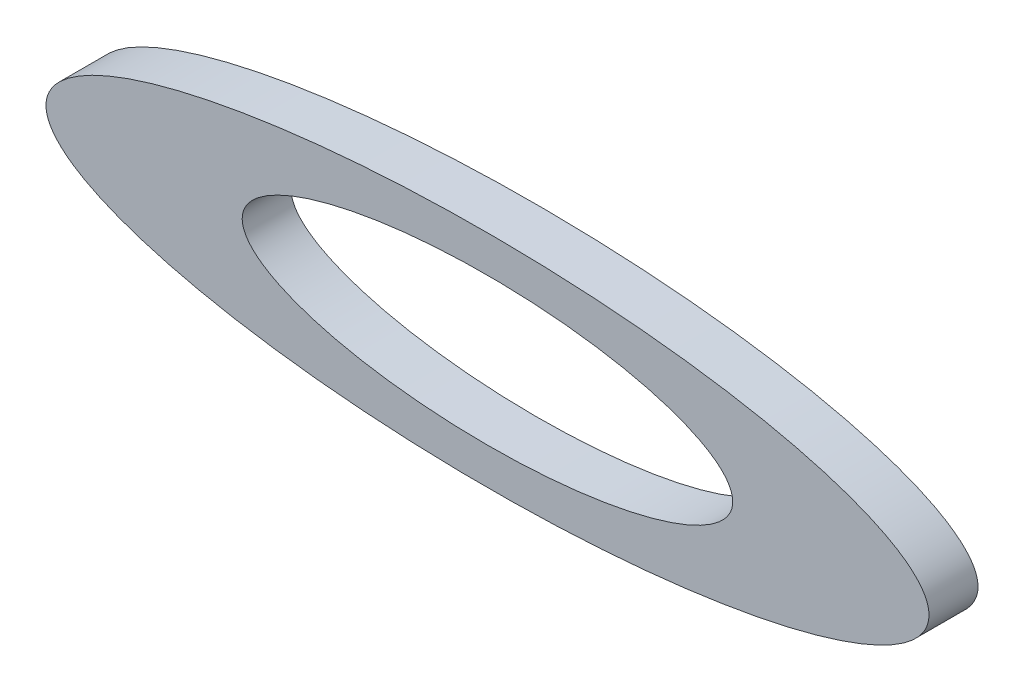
ISO-10303-21;
HEADER;
FILE_DESCRIPTION(('STEP AP214'),'2;1');
FILE_NAME('part.step','',(''),(''),'','','');
FILE_SCHEMA(('AUTOMOTIVE_DESIGN { 1 0 10303 214 1 1 1 1 }'));
ENDSEC;
DATA;
#1=APPLICATION_CONTEXT('core data for automotive mechanical design processes');
#2=APPLICATION_PROTOCOL_DEFINITION('international standard','automotive_design',2000,#1);
#3=PRODUCT_CONTEXT('',#1,'mechanical');
#4=PRODUCT('Part','Part','',(#3));
#5=PRODUCT_RELATED_PRODUCT_CATEGORY('part','',(#4));
#6=PRODUCT_DEFINITION_FORMATION('','',#4);
#7=PRODUCT_DEFINITION_CONTEXT('part definition',#1,'design');
#8=PRODUCT_DEFINITION('design','',#6,#7);
#9=PRODUCT_DEFINITION_SHAPE('','',#8);
#10=(LENGTH_UNIT() NAMED_UNIT(*) SI_UNIT(.MILLI.,.METRE.));
#11=(NAMED_UNIT(*) PLANE_ANGLE_UNIT() SI_UNIT($,.RADIAN.));
#12=(NAMED_UNIT(*) SI_UNIT($,.STERADIAN.) SOLID_ANGLE_UNIT());
#13=UNCERTAINTY_MEASURE_WITH_UNIT(LENGTH_MEASURE(1.E-05),#10,'distance_accuracy_value','');
#14=(GEOMETRIC_REPRESENTATION_CONTEXT(3) GLOBAL_UNCERTAINTY_ASSIGNED_CONTEXT((#13)) GLOBAL_UNIT_ASSIGNED_CONTEXT((#10,
#11,#12)) REPRESENTATION_CONTEXT('',''));
#15=CARTESIAN_POINT('',(0.,0.,0.));
#16=DIRECTION('',(0.,0.,1.));
#17=DIRECTION('',(1.,0.,0.));
#18=AXIS2_PLACEMENT_3D('',#15,#16,#17);
#19=CARTESIAN_POINT('',(0.,0.,10.));
#20=DIRECTION('',(0.,0.,1.));
#21=DIRECTION('',(1.,0.,0.));
#22=AXIS2_PLACEMENT_3D('',#19,#20,#21);
#23=PLANE('',#22);
#24=CARTESIAN_POINT('',(0.,0.,10.));
#25=DIRECTION('',(0.,0.,1.));
#26=DIRECTION('',(1.,0.,0.));
#27=AXIS2_PLACEMENT_3D('',#24,#25,#26);
#28=ELLIPSE('',#27,90.,22.5);
#29=CARTESIAN_POINT('',(90.,0.,10.));
#30=VERTEX_POINT('',#29);
#31=EDGE_CURVE('E10',#30,#30,#28,.T.);
#32=ORIENTED_EDGE('',*,*,#31,.T.);
#33=EDGE_LOOP('',(#32));
#34=FACE_BOUND('',#33,.T.);
#35=CARTESIAN_POINT('',(0.,0.,10.));
#36=DIRECTION('',(0.,0.,1.));
#37=DIRECTION('',(1.,0.,0.));
#38=AXIS2_PLACEMENT_3D('',#35,#36,#37);
#39=ELLIPSE('',#38,50.,15.);
#40=CARTESIAN_POINT('',(50.,0.,10.));
#41=VERTEX_POINT('',#40);
#42=EDGE_CURVE('E39',#41,#41,#39,.T.);
#43=ORIENTED_EDGE('',*,*,#42,.F.);
#44=EDGE_LOOP('',(#43));
#45=FACE_BOUND('',#44,.T.);
#46=ADVANCED_FACE('F27',(#34,#45),#23,.T.);
#47=CARTESIAN_POINT('',(0.,0.,0.));
#48=DIRECTION('',(0.,0.,1.));
#49=DIRECTION('',(1.,0.,0.));
#50=AXIS2_PLACEMENT_3D('',#47,#48,#49);
#51=PLANE('',#50);
#52=CARTESIAN_POINT('',(0.,0.,0.));
#53=DIRECTION('',(0.,0.,1.));
#54=DIRECTION('',(1.,0.,0.));
#55=AXIS2_PLACEMENT_3D('',#52,#53,#54);
#56=ELLIPSE('',#55,90.,22.5);
#57=CARTESIAN_POINT('',(90.,0.,0.));
#58=VERTEX_POINT('',#57);
#59=EDGE_CURVE('E35',#58,#58,#56,.T.);
#60=ORIENTED_EDGE('',*,*,#59,.F.);
#61=EDGE_LOOP('',(#60));
#62=FACE_BOUND('',#61,.T.);
#63=CARTESIAN_POINT('',(0.,0.,0.));
#64=DIRECTION('',(0.,0.,1.));
#65=DIRECTION('',(1.,0.,0.));
#66=AXIS2_PLACEMENT_3D('',#63,#64,#65);
#67=ELLIPSE('',#66,50.,15.);
#68=CARTESIAN_POINT('',(50.,0.,0.));
#69=VERTEX_POINT('',#68);
#70=EDGE_CURVE('E43',#69,#69,#67,.T.);
#71=ORIENTED_EDGE('',*,*,#70,.T.);
#72=EDGE_LOOP('',(#71));
#73=FACE_BOUND('',#72,.T.);
#74=ADVANCED_FACE('F52',(#62,#73),#51,.F.);
#75=DIRECTION('',(0.,0.,-1.));
#76=VECTOR('',#75,1.);
#77=SURFACE_OF_LINEAR_EXTRUSION('',#28,#76);
#78=ORIENTED_EDGE('',*,*,#31,.F.);
#79=EDGE_LOOP('',(#78));
#80=FACE_BOUND('',#79,.T.);
#81=ORIENTED_EDGE('',*,*,#59,.T.);
#82=EDGE_LOOP('',(#81));
#83=FACE_BOUND('',#82,.T.);
#84=ADVANCED_FACE('F29',(#80,#83),#77,.F.);
#85=DIRECTION('',(0.,0.,-1.));
#86=VECTOR('',#85,1.);
#87=SURFACE_OF_LINEAR_EXTRUSION('',#39,#86);
#88=ORIENTED_EDGE('',*,*,#42,.T.);
#89=EDGE_LOOP('',(#88));
#90=FACE_BOUND('',#89,.T.);
#91=ORIENTED_EDGE('',*,*,#70,.F.);
#92=EDGE_LOOP('',(#91));
#93=FACE_BOUND('',#92,.T.);
#94=ADVANCED_FACE('F48',(#90,#93),#87,.T.);
#95=CLOSED_SHELL('',(#46,#74,#84,#94));
#96=MANIFOLD_SOLID_BREP('B2',#95);
#97=ADVANCED_BREP_SHAPE_REPRESENTATION('',(#18,#96),#14);
#98=SHAPE_DEFINITION_REPRESENTATION(#9,#97);
ENDSEC;
END-ISO-10303-21;
